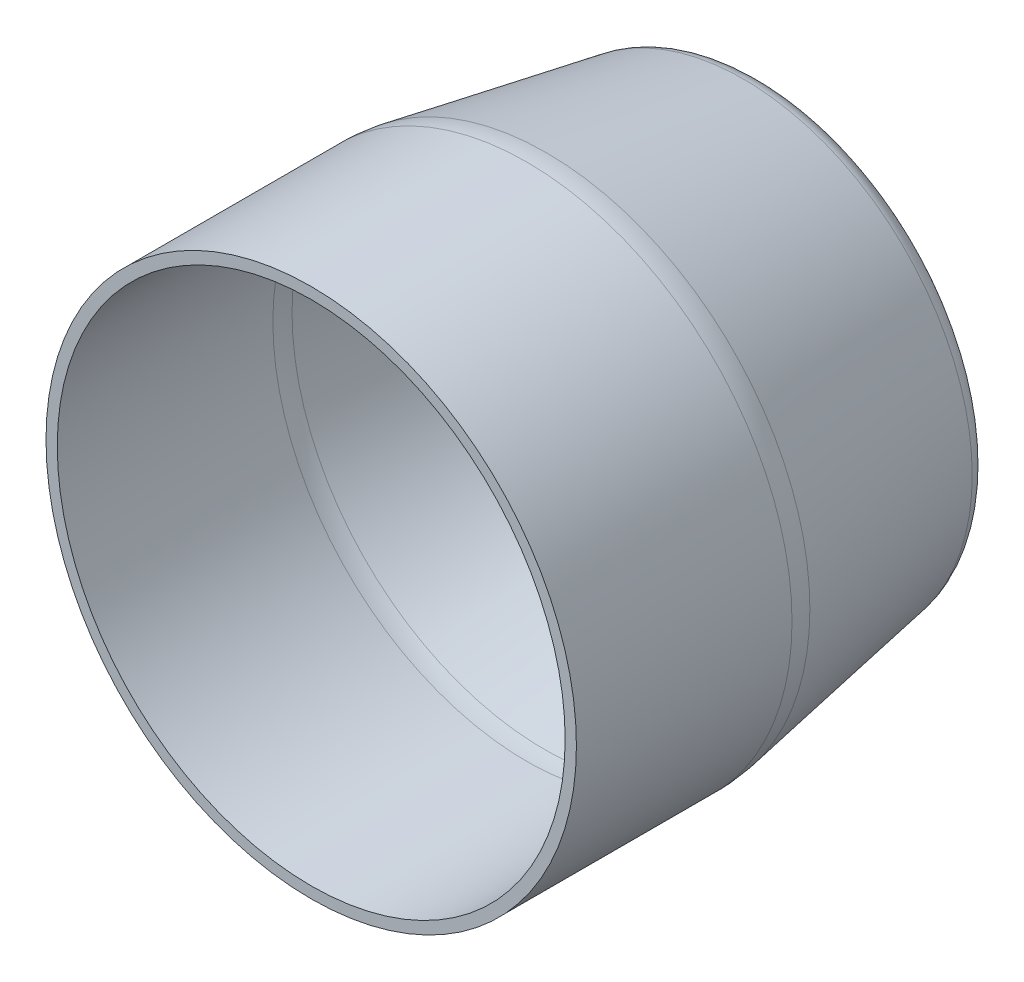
ISO-10303-21;
HEADER;
FILE_DESCRIPTION(('STEP AP214'),'2;1');
FILE_NAME('part.step','',(''),(''),'','','');
FILE_SCHEMA(('AUTOMOTIVE_DESIGN { 1 0 10303 214 1 1 1 1 }'));
ENDSEC;
DATA;
#1=APPLICATION_CONTEXT('core data for automotive mechanical design processes');
#2=APPLICATION_PROTOCOL_DEFINITION('international standard','automotive_design',2000,#1);
#3=PRODUCT_CONTEXT('',#1,'mechanical');
#4=PRODUCT('Part','Part','',(#3));
#5=PRODUCT_RELATED_PRODUCT_CATEGORY('part','',(#4));
#6=PRODUCT_DEFINITION_FORMATION('','',#4);
#7=PRODUCT_DEFINITION_CONTEXT('part definition',#1,'design');
#8=PRODUCT_DEFINITION('design','',#6,#7);
#9=PRODUCT_DEFINITION_SHAPE('','',#8);
#10=(LENGTH_UNIT() NAMED_UNIT(*) SI_UNIT(.MILLI.,.METRE.));
#11=(NAMED_UNIT(*) PLANE_ANGLE_UNIT() SI_UNIT($,.RADIAN.));
#12=(NAMED_UNIT(*) SI_UNIT($,.STERADIAN.) SOLID_ANGLE_UNIT());
#13=UNCERTAINTY_MEASURE_WITH_UNIT(LENGTH_MEASURE(1.E-05),#10,'distance_accuracy_value','');
#14=(GEOMETRIC_REPRESENTATION_CONTEXT(3) GLOBAL_UNCERTAINTY_ASSIGNED_CONTEXT((#13)) GLOBAL_UNIT_ASSIGNED_CONTEXT((#10,
#11,#12)) REPRESENTATION_CONTEXT('',''));
#15=CARTESIAN_POINT('',(0.,0.,0.));
#16=DIRECTION('',(0.,0.,1.));
#17=DIRECTION('',(1.,0.,0.));
#18=AXIS2_PLACEMENT_3D('',#15,#16,#17);
#19=CARTESIAN_POINT('',(0.,0.,0.));
#20=DIRECTION('',(0.,0.,1.));
#21=DIRECTION('',(1.,0.,0.));
#22=AXIS2_PLACEMENT_3D('',#19,#20,#21);
#23=CONICAL_SURFACE('',#22,1000.,0.174532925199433);
#24=CARTESIAN_POINT('',(0.,0.,956.9202429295));
#25=DIRECTION('',(0.,0.,-1.));
#26=DIRECTION('',(-1.,0.,0.));
#27=AXIS2_PLACEMENT_3D('',#24,#25,#26);
#28=CIRCLE('',#27,1168.73085721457);
#29=CARTESIAN_POINT('',(-1168.73085721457,0.,956.9202429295));
#30=VERTEX_POINT('',#29);
#31=EDGE_CURVE('E10',#30,#30,#28,.T.);
#32=ORIENTED_EDGE('',*,*,#31,.T.);
#33=EDGE_LOOP('',(#32));
#34=FACE_BOUND('',#33,.T.);
#35=CARTESIAN_POINT('',(0.,0.,82.6351822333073));
#36=DIRECTION('',(0.,0.,-1.));
#37=DIRECTION('',(-1.,0.,0.));
#38=AXIS2_PLACEMENT_3D('',#35,#36,#37);
#39=CIRCLE('',#38,1014.57081218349);
#40=CARTESIAN_POINT('',(-1014.57081218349,0.,82.6351822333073));
#41=VERTEX_POINT('',#40);
#42=EDGE_CURVE('E46',#41,#41,#39,.F.);
#43=ORIENTED_EDGE('',*,*,#42,.T.);
#44=EDGE_LOOP('',(#43));
#45=FACE_BOUND('',#44,.T.);
#46=ADVANCED_FACE('F32',(#34,#45),#23,.T.);
#47=CARTESIAN_POINT('',(0.,0.,0.));
#48=DIRECTION('',(0.,0.,1.));
#49=DIRECTION('',(1.,0.,0.));
#50=AXIS2_PLACEMENT_3D('',#47,#48,#49);
#51=PLANE('',#50);
#52=CARTESIAN_POINT('',(0.,0.,0.));
#53=DIRECTION('',(0.,0.,1.));
#54=DIRECTION('',(1.,0.,0.));
#55=AXIS2_PLACEMENT_3D('',#52,#53,#54);
#56=CIRCLE('',#55,916.090036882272);
#57=CARTESIAN_POINT('',(916.090036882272,0.,0.));
#58=VERTEX_POINT('',#57);
#59=EDGE_CURVE('E42',#58,#58,#56,.F.);
#60=ORIENTED_EDGE('',*,*,#59,.T.);
#61=EDGE_LOOP('',(#60));
#62=FACE_BOUND('',#61,.T.);
#63=ADVANCED_FACE('F94',(#62),#51,.F.);
#64=CARTESIAN_POINT('',(0.,0.,2000.));
#65=DIRECTION('',(0.,0.,-1.));
#66=DIRECTION('',(-1.,0.,0.));
#67=AXIS2_PLACEMENT_3D('',#64,#65,#66);
#68=CYLINDRICAL_SURFACE('',#67,1176.32698070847);
#69=CARTESIAN_POINT('',(0.,0.,1043.74433176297));
#70=DIRECTION('',(0.,0.,-1.));
#71=DIRECTION('',(-1.,0.,0.));
#72=AXIS2_PLACEMENT_3D('',#69,#70,#71);
#73=CIRCLE('',#72,1176.32698070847);
#74=CARTESIAN_POINT('',(-1176.32698070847,0.,1043.74433176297));
#75=VERTEX_POINT('',#74);
#76=EDGE_CURVE('E38',#75,#75,#73,.F.);
#77=ORIENTED_EDGE('',*,*,#76,.T.);
#78=EDGE_LOOP('',(#77));
#79=FACE_BOUND('',#78,.T.);
#80=CARTESIAN_POINT('',(0.,0.,2000.));
#81=DIRECTION('',(0.,0.,1.));
#82=DIRECTION('',(1.,0.,0.));
#83=AXIS2_PLACEMENT_3D('',#80,#81,#82);
#84=CIRCLE('',#83,1176.32698070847);
#85=CARTESIAN_POINT('',(1176.32698070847,0.,2000.));
#86=VERTEX_POINT('',#85);
#87=EDGE_CURVE('E51',#86,#86,#84,.T.);
#88=ORIENTED_EDGE('',*,*,#87,.F.);
#89=EDGE_LOOP('',(#88));
#90=FACE_BOUND('',#89,.T.);
#91=ADVANCED_FACE('F98',(#79,#90),#68,.T.);
#92=CARTESIAN_POINT('',(0.,0.,2000.));
#93=DIRECTION('',(0.,0.,1.));
#94=DIRECTION('',(1.,0.,0.));
#95=AXIS2_PLACEMENT_3D('',#92,#93,#94);
#96=PLANE('',#95);
#97=CARTESIAN_POINT('',(0.,0.,2000.));
#98=DIRECTION('',(0.,0.,1.));
#99=DIRECTION('',(1.,0.,0.));
#100=AXIS2_PLACEMENT_3D('',#97,#98,#99);
#101=CIRCLE('',#100,1126.32698070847);
#102=CARTESIAN_POINT('',(1126.32698070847,0.,2000.));
#103=VERTEX_POINT('',#102);
#104=EDGE_CURVE('E55',#103,#103,#101,.T.);
#105=ORIENTED_EDGE('',*,*,#104,.F.);
#106=EDGE_LOOP('',(#105));
#107=FACE_BOUND('',#106,.T.);
#108=ORIENTED_EDGE('',*,*,#87,.T.);
#109=EDGE_LOOP('',(#108));
#110=FACE_BOUND('',#109,.T.);
#111=ADVANCED_FACE('F105',(#107,#110),#96,.T.);
#112=CARTESIAN_POINT('',(0.,0.,100.));
#113=DIRECTION('',(0.,0.,1.));
#114=DIRECTION('',(1.,0.,0.));
#115=AXIS2_PLACEMENT_3D('',#112,#113,#114);
#116=TOROIDAL_SURFACE('',#115,916.090036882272,100.);
#117=ORIENTED_EDGE('',*,*,#59,.F.);
#118=EDGE_LOOP('',(#117));
#119=FACE_BOUND('',#118,.T.);
#120=ORIENTED_EDGE('',*,*,#42,.F.);
#121=EDGE_LOOP('',(#120));
#122=FACE_BOUND('',#121,.T.);
#123=ADVANCED_FACE('F103',(#119,#122),#116,.T.);
#124=CARTESIAN_POINT('',(0.,0.,1043.74433176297));
#125=DIRECTION('',(0.,0.,-1.));
#126=DIRECTION('',(-1.,0.,0.));
#127=AXIS2_PLACEMENT_3D('',#124,#125,#126);
#128=TOROIDAL_SURFACE('',#127,676.326980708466,500.);
#129=ORIENTED_EDGE('',*,*,#31,.F.);
#130=EDGE_LOOP('',(#129));
#131=FACE_BOUND('',#130,.T.);
#132=ORIENTED_EDGE('',*,*,#76,.F.);
#133=EDGE_LOOP('',(#132));
#134=FACE_BOUND('',#133,.T.);
#135=ADVANCED_FACE('F77',(#131,#134),#128,.T.);
#136=CARTESIAN_POINT('',(0.,0.,8.68240888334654));
#137=DIRECTION('',(0.,0.,1.));
#138=DIRECTION('',(1.,0.,0.));
#139=AXIS2_PLACEMENT_3D('',#136,#137,#138);
#140=CONICAL_SURFACE('',#139,950.759612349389,0.174532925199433);
#141=CARTESIAN_POINT('',(0.,0.,965.602651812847));
#142=DIRECTION('',(0.,0.,1.));
#143=DIRECTION('',(1.,0.,0.));
#144=AXIS2_PLACEMENT_3D('',#141,#142,#143);
#145=CIRCLE('',#144,1119.49046956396);
#146=CARTESIAN_POINT('',(1119.49046956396,0.,965.602651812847));
#147=VERTEX_POINT('',#146);
#148=EDGE_CURVE('E54',#147,#147,#145,.F.);
#149=ORIENTED_EDGE('',*,*,#148,.F.);
#150=EDGE_LOOP('',(#149));
#151=FACE_BOUND('',#150,.T.);
#152=CARTESIAN_POINT('',(0.,0.,91.3175911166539));
#153=DIRECTION('',(0.,0.,1.));
#154=DIRECTION('',(1.,0.,0.));
#155=AXIS2_PLACEMENT_3D('',#152,#153,#154);
#156=CIRCLE('',#155,965.330424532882);
#157=CARTESIAN_POINT('',(965.330424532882,0.,91.3175911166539));
#158=VERTEX_POINT('',#157);
#159=EDGE_CURVE('E58',#158,#158,#156,.T.);
#160=ORIENTED_EDGE('',*,*,#159,.F.);
#161=EDGE_LOOP('',(#160));
#162=FACE_BOUND('',#161,.T.);
#163=ADVANCED_FACE('F73',(#151,#162),#140,.F.);
#164=CARTESIAN_POINT('',(0.,0.,50.));
#165=DIRECTION('',(0.,0.,1.));
#166=DIRECTION('',(1.,0.,0.));
#167=AXIS2_PLACEMENT_3D('',#164,#165,#166);
#168=PLANE('',#167);
#169=CARTESIAN_POINT('',(0.,0.,50.));
#170=DIRECTION('',(0.,0.,1.));
#171=DIRECTION('',(1.,0.,0.));
#172=AXIS2_PLACEMENT_3D('',#169,#170,#171);
#173=CIRCLE('',#172,916.090036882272);
#174=CARTESIAN_POINT('',(916.090036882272,0.,50.));
#175=VERTEX_POINT('',#174);
#176=EDGE_CURVE('E62',#175,#175,#173,.F.);
#177=ORIENTED_EDGE('',*,*,#176,.F.);
#178=EDGE_LOOP('',(#177));
#179=FACE_BOUND('',#178,.T.);
#180=ADVANCED_FACE('F76',(#179),#168,.T.);
#181=CARTESIAN_POINT('',(0.,0.,2000.));
#182=DIRECTION('',(0.,0.,-1.));
#183=DIRECTION('',(-1.,0.,0.));
#184=AXIS2_PLACEMENT_3D('',#181,#182,#183);
#185=CYLINDRICAL_SURFACE('',#184,1126.32698070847);
#186=CARTESIAN_POINT('',(0.,0.,1043.74433176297));
#187=DIRECTION('',(0.,0.,-1.));
#188=DIRECTION('',(-1.,0.,0.));
#189=AXIS2_PLACEMENT_3D('',#186,#187,#188);
#190=CIRCLE('',#189,1126.32698070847);
#191=CARTESIAN_POINT('',(-1126.32698070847,0.,1043.74433176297));
#192=VERTEX_POINT('',#191);
#193=EDGE_CURVE('E59',#192,#192,#190,.F.);
#194=ORIENTED_EDGE('',*,*,#193,.F.);
#195=EDGE_LOOP('',(#194));
#196=FACE_BOUND('',#195,.T.);
#197=ORIENTED_EDGE('',*,*,#104,.T.);
#198=EDGE_LOOP('',(#197));
#199=FACE_BOUND('',#198,.T.);
#200=ADVANCED_FACE('F83',(#196,#199),#185,.F.);
#201=CARTESIAN_POINT('',(0.,0.,100.));
#202=DIRECTION('',(0.,0.,1.));
#203=DIRECTION('',(1.,0.,0.));
#204=AXIS2_PLACEMENT_3D('',#201,#202,#203);
#205=TOROIDAL_SURFACE('',#204,916.090036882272,50.);
#206=ORIENTED_EDGE('',*,*,#176,.T.);
#207=EDGE_LOOP('',(#206));
#208=FACE_BOUND('',#207,.T.);
#209=ORIENTED_EDGE('',*,*,#159,.T.);
#210=EDGE_LOOP('',(#209));
#211=FACE_BOUND('',#210,.T.);
#212=ADVANCED_FACE('F81',(#208,#211),#205,.F.);
#213=CARTESIAN_POINT('',(0.,0.,1043.74433176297));
#214=DIRECTION('',(0.,0.,-1.));
#215=DIRECTION('',(-1.,0.,0.));
#216=AXIS2_PLACEMENT_3D('',#213,#214,#215);
#217=TOROIDAL_SURFACE('',#216,676.326980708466,450.);
#218=ORIENTED_EDGE('',*,*,#148,.T.);
#219=EDGE_LOOP('',(#218));
#220=FACE_BOUND('',#219,.T.);
#221=ORIENTED_EDGE('',*,*,#193,.T.);
#222=EDGE_LOOP('',(#221));
#223=FACE_BOUND('',#222,.T.);
#224=ADVANCED_FACE('F70',(#220,#223),#217,.F.);
#225=CLOSED_SHELL('',(#46,#63,#91,#111,#123,#135,#163,#180,#200,#212,#224));
#226=MANIFOLD_SOLID_BREP('B2',#225);
#227=ADVANCED_BREP_SHAPE_REPRESENTATION('',(#18,#226),#14);
#228=SHAPE_DEFINITION_REPRESENTATION(#9,#227);
ENDSEC;
END-ISO-10303-21;
